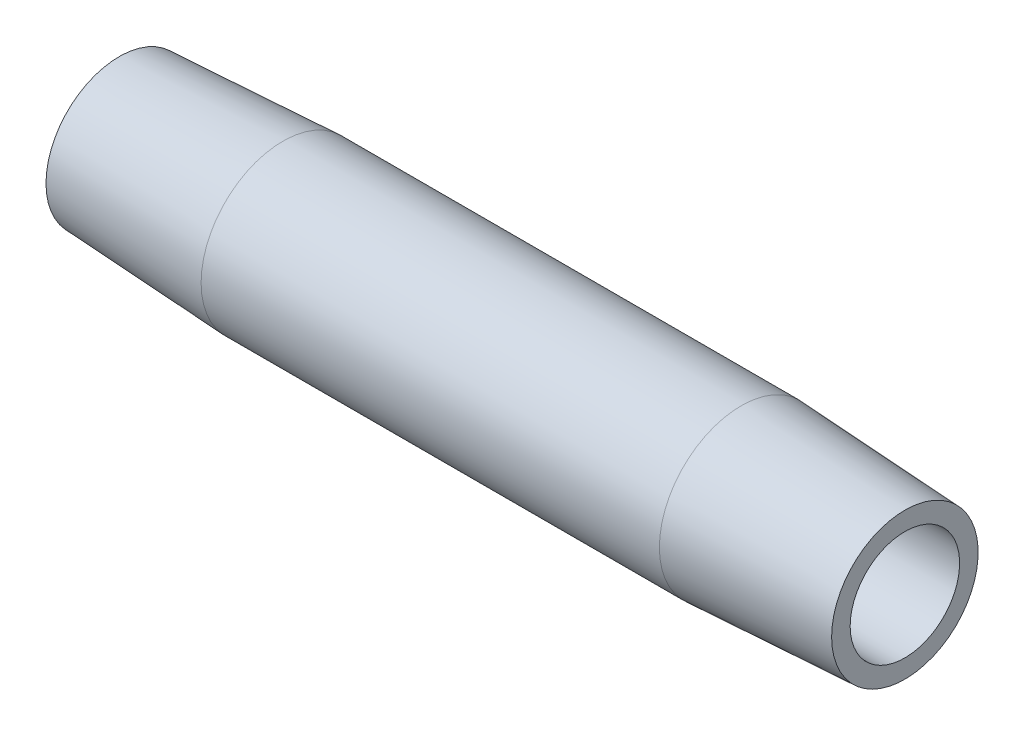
ISO-10303-21;
HEADER;
FILE_DESCRIPTION(('STEP AP214'),'2;1');
FILE_NAME('part.step','',(''),(''),'','','');
FILE_SCHEMA(('AUTOMOTIVE_DESIGN { 1 0 10303 214 1 1 1 1 }'));
ENDSEC;
DATA;
#1=APPLICATION_CONTEXT('core data for automotive mechanical design processes');
#2=APPLICATION_PROTOCOL_DEFINITION('international standard','automotive_design',2000,#1);
#3=PRODUCT_CONTEXT('',#1,'mechanical');
#4=PRODUCT('Part','Part','',(#3));
#5=PRODUCT_RELATED_PRODUCT_CATEGORY('part','',(#4));
#6=PRODUCT_DEFINITION_FORMATION('','',#4);
#7=PRODUCT_DEFINITION_CONTEXT('part definition',#1,'design');
#8=PRODUCT_DEFINITION('design','',#6,#7);
#9=PRODUCT_DEFINITION_SHAPE('','',#8);
#10=(LENGTH_UNIT() NAMED_UNIT(*) SI_UNIT(.MILLI.,.METRE.));
#11=(NAMED_UNIT(*) PLANE_ANGLE_UNIT() SI_UNIT($,.RADIAN.));
#12=(NAMED_UNIT(*) SI_UNIT($,.STERADIAN.) SOLID_ANGLE_UNIT());
#13=UNCERTAINTY_MEASURE_WITH_UNIT(LENGTH_MEASURE(1.E-05),#10,'distance_accuracy_value','');
#14=(GEOMETRIC_REPRESENTATION_CONTEXT(3) GLOBAL_UNCERTAINTY_ASSIGNED_CONTEXT((#13)) GLOBAL_UNIT_ASSIGNED_CONTEXT((#10,
#11,#12)) REPRESENTATION_CONTEXT('',''));
#15=CARTESIAN_POINT('',(0.,0.,0.));
#16=DIRECTION('',(0.,0.,1.));
#17=DIRECTION('',(1.,0.,0.));
#18=AXIS2_PLACEMENT_3D('',#15,#16,#17);
#19=CARTESIAN_POINT('',(0.476141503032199,0.,0.));
#20=DIRECTION('',(-1.,0.,0.));
#21=DIRECTION('',(0.,0.,1.));
#22=AXIS2_PLACEMENT_3D('',#19,#20,#21);
#23=CYLINDRICAL_SURFACE('',#22,3.96875);
#24=CARTESIAN_POINT('',(7.9375,0.,0.));
#25=DIRECTION('',(-1.,0.,0.));
#26=DIRECTION('',(0.,0.,1.));
#27=AXIS2_PLACEMENT_3D('',#24,#25,#26);
#28=CIRCLE('',#27,3.96875);
#29=CARTESIAN_POINT('',(7.9375,0.,3.96875));
#30=VERTEX_POINT('',#29);
#31=EDGE_CURVE('E10',#30,#30,#28,.T.);
#32=ORIENTED_EDGE('',*,*,#31,.F.);
#33=EDGE_LOOP('',(#32));
#34=FACE_BOUND('',#33,.T.);
#35=CARTESIAN_POINT('',(30.1625,0.,0.));
#36=DIRECTION('',(-1.,0.,0.));
#37=DIRECTION('',(0.,0.,1.));
#38=AXIS2_PLACEMENT_3D('',#35,#36,#37);
#39=CIRCLE('',#38,3.96875);
#40=CARTESIAN_POINT('',(30.1625,0.,3.96875));
#41=VERTEX_POINT('',#40);
#42=EDGE_CURVE('E52',#41,#41,#39,.T.);
#43=ORIENTED_EDGE('',*,*,#42,.T.);
#44=EDGE_LOOP('',(#43));
#45=FACE_BOUND('',#44,.T.);
#46=ADVANCED_FACE('F30',(#34,#45),#23,.T.);
#47=CARTESIAN_POINT('',(7.9375,0.,0.));
#48=DIRECTION('',(1.,0.,0.));
#49=DIRECTION('',(0.,0.,-1.));
#50=AXIS2_PLACEMENT_3D('',#47,#48,#49);
#51=CONICAL_SURFACE('',#50,3.96875,0.0523598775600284);
#52=CARTESIAN_POINT('',(0.,0.,0.));
#53=DIRECTION('',(-1.,0.,0.));
#54=DIRECTION('',(0.,0.,1.));
#55=AXIS2_PLACEMENT_3D('',#52,#53,#54);
#56=CIRCLE('',#55,3.55276325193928);
#57=CARTESIAN_POINT('',(0.,0.,3.55276325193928));
#58=VERTEX_POINT('',#57);
#59=EDGE_CURVE('E36',#58,#58,#56,.T.);
#60=ORIENTED_EDGE('',*,*,#59,.F.);
#61=EDGE_LOOP('',(#60));
#62=FACE_BOUND('',#61,.T.);
#63=ORIENTED_EDGE('',*,*,#31,.T.);
#64=EDGE_LOOP('',(#63));
#65=FACE_BOUND('',#64,.T.);
#66=ADVANCED_FACE('F77',(#62,#65),#51,.T.);
#67=CARTESIAN_POINT('',(0.,3.55276325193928,0.));
#68=DIRECTION('',(1.,0.,0.));
#69=DIRECTION('',(0.,0.,-1.));
#70=AXIS2_PLACEMENT_3D('',#67,#68,#69);
#71=PLANE('',#70);
#72=CARTESIAN_POINT('',(0.,0.,0.));
#73=DIRECTION('',(-1.,0.,0.));
#74=DIRECTION('',(0.,0.,1.));
#75=AXIS2_PLACEMENT_3D('',#72,#73,#74);
#76=CIRCLE('',#75,2.65429999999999);
#77=CARTESIAN_POINT('',(0.,0.,2.65429999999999));
#78=VERTEX_POINT('',#77);
#79=EDGE_CURVE('E40',#78,#78,#76,.T.);
#80=ORIENTED_EDGE('',*,*,#79,.F.);
#81=EDGE_LOOP('',(#80));
#82=FACE_BOUND('',#81,.T.);
#83=ORIENTED_EDGE('',*,*,#59,.T.);
#84=EDGE_LOOP('',(#83));
#85=FACE_BOUND('',#84,.T.);
#86=ADVANCED_FACE('F72',(#82,#85),#71,.F.);
#87=CARTESIAN_POINT('',(0.476141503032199,0.,0.));
#88=DIRECTION('',(-1.,0.,0.));
#89=DIRECTION('',(0.,0.,1.));
#90=AXIS2_PLACEMENT_3D('',#87,#88,#89);
#91=CYLINDRICAL_SURFACE('',#90,2.6543);
#92=CARTESIAN_POINT('',(38.1,0.,0.));
#93=DIRECTION('',(-1.,0.,0.));
#94=DIRECTION('',(0.,0.,1.));
#95=AXIS2_PLACEMENT_3D('',#92,#93,#94);
#96=CIRCLE('',#95,2.6543);
#97=CARTESIAN_POINT('',(38.1,0.,2.6543));
#98=VERTEX_POINT('',#97);
#99=EDGE_CURVE('E44',#98,#98,#96,.T.);
#100=ORIENTED_EDGE('',*,*,#99,.F.);
#101=EDGE_LOOP('',(#100));
#102=FACE_BOUND('',#101,.T.);
#103=ORIENTED_EDGE('',*,*,#79,.T.);
#104=EDGE_LOOP('',(#103));
#105=FACE_BOUND('',#104,.T.);
#106=ADVANCED_FACE('F66',(#102,#105),#91,.F.);
#107=CARTESIAN_POINT('',(38.1,2.6543,0.));
#108=DIRECTION('',(-1.,0.,0.));
#109=DIRECTION('',(0.,0.,1.));
#110=AXIS2_PLACEMENT_3D('',#107,#108,#109);
#111=PLANE('',#110);
#112=CARTESIAN_POINT('',(38.1,0.,0.));
#113=DIRECTION('',(-1.,0.,0.));
#114=DIRECTION('',(0.,0.,1.));
#115=AXIS2_PLACEMENT_3D('',#112,#113,#114);
#116=CIRCLE('',#115,3.55276325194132);
#117=CARTESIAN_POINT('',(38.1,0.,3.55276325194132));
#118=VERTEX_POINT('',#117);
#119=EDGE_CURVE('E49',#118,#118,#116,.T.);
#120=ORIENTED_EDGE('',*,*,#119,.F.);
#121=EDGE_LOOP('',(#120));
#122=FACE_BOUND('',#121,.T.);
#123=ORIENTED_EDGE('',*,*,#99,.T.);
#124=EDGE_LOOP('',(#123));
#125=FACE_BOUND('',#124,.T.);
#126=ADVANCED_FACE('F60',(#122,#125),#111,.F.);
#127=CARTESIAN_POINT('',(38.1,0.,0.));
#128=DIRECTION('',(-1.,0.,0.));
#129=DIRECTION('',(0.,0.,1.));
#130=AXIS2_PLACEMENT_3D('',#127,#128,#129);
#131=CONICAL_SURFACE('',#130,3.55276325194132,0.0523598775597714);
#132=ORIENTED_EDGE('',*,*,#42,.F.);
#133=EDGE_LOOP('',(#132));
#134=FACE_BOUND('',#133,.T.);
#135=ORIENTED_EDGE('',*,*,#119,.T.);
#136=EDGE_LOOP('',(#135));
#137=FACE_BOUND('',#136,.T.);
#138=ADVANCED_FACE('F57',(#134,#137),#131,.T.);
#139=CLOSED_SHELL('',(#46,#66,#86,#106,#126,#138));
#140=MANIFOLD_SOLID_BREP('B2',#139);
#141=ADVANCED_BREP_SHAPE_REPRESENTATION('',(#18,#140),#14);
#142=SHAPE_DEFINITION_REPRESENTATION(#9,#141);
ENDSEC;
END-ISO-10303-21;
